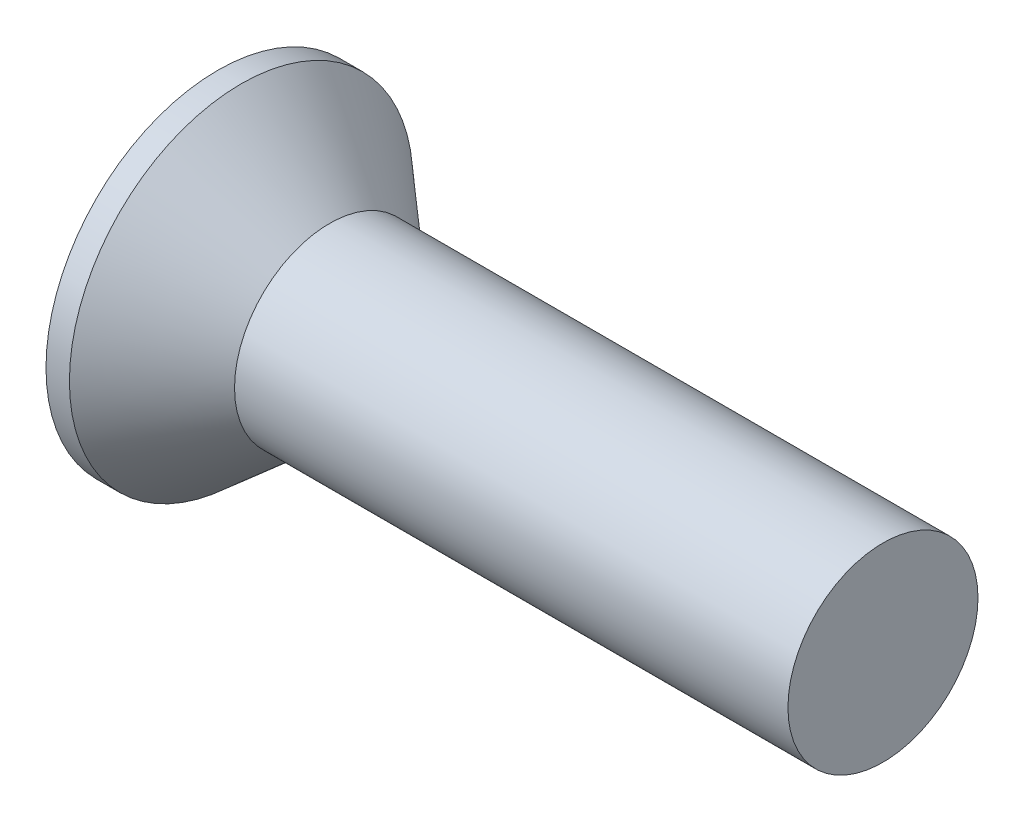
ISO-10303-21;
HEADER;
FILE_DESCRIPTION(('STEP AP214'),'2;1');
FILE_NAME('part.step','',(''),(''),'','','');
FILE_SCHEMA(('AUTOMOTIVE_DESIGN { 1 0 10303 214 1 1 1 1 }'));
ENDSEC;
DATA;
#1=APPLICATION_CONTEXT('core data for automotive mechanical design processes');
#2=APPLICATION_PROTOCOL_DEFINITION('international standard','automotive_design',2000,#1);
#3=PRODUCT_CONTEXT('',#1,'mechanical');
#4=PRODUCT('Part','Part','',(#3));
#5=PRODUCT_RELATED_PRODUCT_CATEGORY('part','',(#4));
#6=PRODUCT_DEFINITION_FORMATION('','',#4);
#7=PRODUCT_DEFINITION_CONTEXT('part definition',#1,'design');
#8=PRODUCT_DEFINITION('design','',#6,#7);
#9=PRODUCT_DEFINITION_SHAPE('','',#8);
#10=(LENGTH_UNIT() NAMED_UNIT(*) SI_UNIT(.MILLI.,.METRE.));
#11=(NAMED_UNIT(*) PLANE_ANGLE_UNIT() SI_UNIT($,.RADIAN.));
#12=(NAMED_UNIT(*) SI_UNIT($,.STERADIAN.) SOLID_ANGLE_UNIT());
#13=UNCERTAINTY_MEASURE_WITH_UNIT(LENGTH_MEASURE(1.E-05),#10,'distance_accuracy_value','');
#14=(GEOMETRIC_REPRESENTATION_CONTEXT(3) GLOBAL_UNCERTAINTY_ASSIGNED_CONTEXT((#13)) GLOBAL_UNIT_ASSIGNED_CONTEXT((#10,
#11,#12)) REPRESENTATION_CONTEXT('',''));
#15=CARTESIAN_POINT('',(0.,0.,0.));
#16=DIRECTION('',(0.,0.,1.));
#17=DIRECTION('',(1.,0.,0.));
#18=AXIS2_PLACEMENT_3D('',#15,#16,#17);
#19=CARTESIAN_POINT('',(0.,0.,0.));
#20=DIRECTION('',(-1.,0.,0.));
#21=DIRECTION('',(0.,0.,1.));
#22=AXIS2_PLACEMENT_3D('',#19,#20,#21);
#23=PLANE('',#22);
#24=CARTESIAN_POINT('',(0.,0.,0.));
#25=DIRECTION('',(-1.,0.,0.));
#26=DIRECTION('',(0.,0.,1.));
#27=AXIS2_PLACEMENT_3D('',#24,#25,#26);
#28=CIRCLE('',#27,5.7404);
#29=CARTESIAN_POINT('',(0.,0.,5.7404));
#30=VERTEX_POINT('',#29);
#31=EDGE_CURVE('E39',#30,#30,#28,.T.);
#32=ORIENTED_EDGE('',*,*,#31,.T.);
#33=EDGE_LOOP('',(#32));
#34=FACE_BOUND('',#33,.T.);
#35=DIRECTION('',(0.,1.,0.));
#36=VECTOR('',#35,1.);
#37=CARTESIAN_POINT('',(0.,-4.5085,-0.7747));
#38=LINE('',#37,#36);
#39=CARTESIAN_POINT('',(0.,-4.5085,-0.7747));
#40=VERTEX_POINT('',#39);
#41=CARTESIAN_POINT('',(0.,-0.774699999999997,-0.7747));
#42=VERTEX_POINT('',#41);
#43=EDGE_CURVE('E100',#40,#42,#38,.T.);
#44=ORIENTED_EDGE('',*,*,#43,.T.);
#45=DIRECTION('',(0.,0.,-1.));
#46=VECTOR('',#45,1.);
#47=CARTESIAN_POINT('',(0.,-0.774700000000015,4.5085));
#48=LINE('',#47,#46);
#49=CARTESIAN_POINT('',(0.,-0.774699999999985,-4.5085));
#50=VERTEX_POINT('',#49);
#51=EDGE_CURVE('E80',#42,#50,#48,.T.);
#52=ORIENTED_EDGE('',*,*,#51,.T.);
#53=DIRECTION('',(0.,1.,0.));
#54=VECTOR('',#53,1.);
#55=CARTESIAN_POINT('',(0.,-0.774699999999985,-4.5085));
#56=LINE('',#55,#54);
#57=CARTESIAN_POINT('',(0.,0.774700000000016,-4.5085));
#58=VERTEX_POINT('',#57);
#59=EDGE_CURVE('E335',#50,#58,#56,.T.);
#60=ORIENTED_EDGE('',*,*,#59,.T.);
#61=DIRECTION('',(0.,0.,1.));
#62=VECTOR('',#61,1.);
#63=CARTESIAN_POINT('',(0.,0.774700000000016,-4.5085));
#64=LINE('',#63,#62);
#65=CARTESIAN_POINT('',(0.,0.774700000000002,-0.7747));
#66=VERTEX_POINT('',#65);
#67=EDGE_CURVE('E96',#58,#66,#64,.T.);
#68=ORIENTED_EDGE('',*,*,#67,.T.);
#69=CARTESIAN_POINT('',(0.,4.5085,-0.7747));
#70=VERTEX_POINT('',#69);
#71=EDGE_CURVE('E90',#66,#70,#38,.T.);
#72=ORIENTED_EDGE('',*,*,#71,.T.);
#73=DIRECTION('',(0.,0.,1.));
#74=VECTOR('',#73,1.);
#75=CARTESIAN_POINT('',(0.,4.5085,-0.7747));
#76=LINE('',#75,#74);
#77=CARTESIAN_POINT('',(0.,4.5085,0.774699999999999));
#78=VERTEX_POINT('',#77);
#79=EDGE_CURVE('E93',#70,#78,#76,.T.);
#80=ORIENTED_EDGE('',*,*,#79,.T.);
#81=DIRECTION('',(0.,-1.,0.));
#82=VECTOR('',#81,1.);
#83=CARTESIAN_POINT('',(0.,4.5085,0.774699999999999));
#84=LINE('',#83,#82);
#85=CARTESIAN_POINT('',(0.,0.774699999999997,0.7747));
#86=VERTEX_POINT('',#85);
#87=EDGE_CURVE('E347',#78,#86,#84,.T.);
#88=ORIENTED_EDGE('',*,*,#87,.T.);
#89=CARTESIAN_POINT('',(0.,0.774699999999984,4.5085));
#90=VERTEX_POINT('',#89);
#91=EDGE_CURVE('E330',#86,#90,#64,.T.);
#92=ORIENTED_EDGE('',*,*,#91,.T.);
#93=DIRECTION('',(0.,-1.,0.));
#94=VECTOR('',#93,1.);
#95=CARTESIAN_POINT('',(0.,0.774699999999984,4.5085));
#96=LINE('',#95,#94);
#97=CARTESIAN_POINT('',(0.,-0.774700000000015,4.5085));
#98=VERTEX_POINT('',#97);
#99=EDGE_CURVE('E316',#90,#98,#96,.T.);
#100=ORIENTED_EDGE('',*,*,#99,.T.);
#101=CARTESIAN_POINT('',(0.,-0.774700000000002,0.7747));
#102=VERTEX_POINT('',#101);
#103=EDGE_CURVE('E328',#98,#102,#48,.T.);
#104=ORIENTED_EDGE('',*,*,#103,.T.);
#105=CARTESIAN_POINT('',(0.,-4.5085,0.7747));
#106=VERTEX_POINT('',#105);
#107=EDGE_CURVE('E106',#102,#106,#84,.T.);
#108=ORIENTED_EDGE('',*,*,#107,.T.);
#109=DIRECTION('',(0.,0.,-1.));
#110=VECTOR('',#109,1.);
#111=CARTESIAN_POINT('',(0.,-4.5085,0.7747));
#112=LINE('',#111,#110);
#113=EDGE_CURVE('E129',#106,#40,#112,.T.);
#114=ORIENTED_EDGE('',*,*,#113,.T.);
#115=EDGE_LOOP('',(#44,#52,#60,#68,#72,#80,#88,#92,#100,#104,#108,#114));
#116=FACE_BOUND('',#115,.T.);
#117=ADVANCED_FACE('F32',(#34,#116),#23,.T.);
#118=CARTESIAN_POINT('',(5.66862249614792,0.,0.350942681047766));
#119=DIRECTION('',(-0.074546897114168,0.,-0.997217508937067));
#120=DIRECTION('',(-0.997217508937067,0.,0.074546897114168));
#121=AXIS2_PLACEMENT_3D('',#118,#119,#120);
#122=PLANE('',#121);
#123=ORIENTED_EDGE('',*,*,#107,.F.);
#124=DIRECTION('',(0.994458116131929,0.0743406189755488,-0.0743406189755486));
#125=VECTOR('',#124,1.);
#126=CARTESIAN_POINT('',(5.69456720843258,-0.349003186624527,0.349003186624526));
#127=LINE('',#126,#125);
#128=CARTESIAN_POINT('',(5.1816,-0.387350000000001,0.387349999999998));
#129=VERTEX_POINT('',#128);
#130=EDGE_CURVE('E124',#102,#129,#127,.T.);
#131=ORIENTED_EDGE('',*,*,#130,.T.);
#132=DIRECTION('',(0.781307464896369,0.621407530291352,-0.058406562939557));
#133=VECTOR('',#132,1.);
#134=CARTESIAN_POINT('',(0.,-4.5085,0.7747));
#135=LINE('',#134,#133);
#136=EDGE_CURVE('E101',#106,#129,#135,.T.);
#137=ORIENTED_EDGE('',*,*,#136,.F.);
#138=EDGE_LOOP('',(#123,#131,#137));
#139=FACE_BOUND('',#138,.T.);
#140=ADVANCED_FACE('F152',(#139),#122,.T.);
#141=DIRECTION('',(0.781307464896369,-0.621407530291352,-0.0584065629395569));
#142=VECTOR('',#141,1.);
#143=CARTESIAN_POINT('',(0.,4.5085,0.774699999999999));
#144=LINE('',#143,#142);
#145=CARTESIAN_POINT('',(5.1816,0.387349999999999,0.38735));
#146=VERTEX_POINT('',#145);
#147=EDGE_CURVE('E46',#78,#146,#144,.T.);
#148=ORIENTED_EDGE('',*,*,#147,.T.);
#149=DIRECTION('',(-0.994458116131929,0.0743406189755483,0.0743406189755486));
#150=VECTOR('',#149,1.);
#151=CARTESIAN_POINT('',(5.69456720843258,0.349003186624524,0.349003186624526));
#152=LINE('',#151,#150);
#153=EDGE_CURVE('E343',#146,#86,#152,.T.);
#154=ORIENTED_EDGE('',*,*,#153,.T.);
#155=ORIENTED_EDGE('',*,*,#87,.F.);
#156=EDGE_LOOP('',(#148,#154,#155));
#157=FACE_BOUND('',#156,.T.);
#158=ADVANCED_FACE('F156',(#157),#122,.T.);
#159=CARTESIAN_POINT('',(5.66862249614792,0.,-0.350942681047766));
#160=DIRECTION('',(-0.074546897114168,0.,0.997217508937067));
#161=DIRECTION('',(0.997217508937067,0.,0.074546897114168));
#162=AXIS2_PLACEMENT_3D('',#159,#160,#161);
#163=PLANE('',#162);
#164=DIRECTION('',(0.781307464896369,0.621407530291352,0.058406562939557));
#165=VECTOR('',#164,1.);
#166=CARTESIAN_POINT('',(0.,-4.5085,-0.7747));
#167=LINE('',#166,#165);
#168=CARTESIAN_POINT('',(5.1816,-0.387349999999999,-0.387350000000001));
#169=VERTEX_POINT('',#168);
#170=EDGE_CURVE('E55',#40,#169,#167,.T.);
#171=ORIENTED_EDGE('',*,*,#170,.T.);
#172=DIRECTION('',(-0.994458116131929,-0.0743406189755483,-0.0743406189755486));
#173=VECTOR('',#172,1.);
#174=CARTESIAN_POINT('',(5.69456720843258,-0.349003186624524,-0.349003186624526));
#175=LINE('',#174,#173);
#176=EDGE_CURVE('E11',#169,#42,#175,.T.);
#177=ORIENTED_EDGE('',*,*,#176,.T.);
#178=ORIENTED_EDGE('',*,*,#43,.F.);
#179=EDGE_LOOP('',(#171,#177,#178));
#180=FACE_BOUND('',#179,.T.);
#181=ADVANCED_FACE('F149',(#180),#163,.T.);
#182=ORIENTED_EDGE('',*,*,#71,.F.);
#183=DIRECTION('',(0.994458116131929,-0.0743406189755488,0.0743406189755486));
#184=VECTOR('',#183,1.);
#185=CARTESIAN_POINT('',(5.69456720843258,0.349003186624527,-0.349003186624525));
#186=LINE('',#185,#184);
#187=CARTESIAN_POINT('',(5.1816,0.387349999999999,-0.38735));
#188=VERTEX_POINT('',#187);
#189=EDGE_CURVE('E109',#66,#188,#186,.T.);
#190=ORIENTED_EDGE('',*,*,#189,.T.);
#191=DIRECTION('',(0.781307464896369,-0.621407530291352,0.0584065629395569));
#192=VECTOR('',#191,1.);
#193=CARTESIAN_POINT('',(0.,4.5085,-0.7747));
#194=LINE('',#193,#192);
#195=EDGE_CURVE('E105',#70,#188,#194,.T.);
#196=ORIENTED_EDGE('',*,*,#195,.F.);
#197=EDGE_LOOP('',(#182,#190,#196));
#198=FACE_BOUND('',#197,.T.);
#199=ADVANCED_FACE('F108',(#198),#163,.T.);
#200=CARTESIAN_POINT('',(-6.34999999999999,0.,0.));
#201=DIRECTION('',(-1.,0.,0.));
#202=DIRECTION('',(0.,0.,1.));
#203=AXIS2_PLACEMENT_3D('',#200,#201,#202);
#204=CYLINDRICAL_SURFACE('',#203,5.7404);
#205=CARTESIAN_POINT('',(0.782644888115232,0.,0.));
#206=DIRECTION('',(-1.,0.,0.));
#207=DIRECTION('',(0.,0.,1.));
#208=AXIS2_PLACEMENT_3D('',#205,#206,#207);
#209=CIRCLE('',#208,5.7404);
#210=CARTESIAN_POINT('',(0.782644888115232,0.,5.7404));
#211=VERTEX_POINT('',#210);
#212=EDGE_CURVE('E132',#211,#211,#209,.T.);
#213=ORIENTED_EDGE('',*,*,#212,.T.);
#214=EDGE_LOOP('',(#213));
#215=FACE_BOUND('',#214,.T.);
#216=ORIENTED_EDGE('',*,*,#31,.F.);
#217=EDGE_LOOP('',(#216));
#218=FACE_BOUND('',#217,.T.);
#219=ADVANCED_FACE('F138',(#215,#218),#204,.T.);
#220=CARTESIAN_POINT('',(0.782644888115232,0.,0.));
#221=DIRECTION('',(-1.,0.,0.));
#222=DIRECTION('',(0.,0.,1.));
#223=AXIS2_PLACEMENT_3D('',#220,#221,#222);
#224=CONICAL_SURFACE('',#223,5.7404,0.715584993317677);
#225=CARTESIAN_POINT('',(3.7338,0.,0.));
#226=DIRECTION('',(-1.,0.,0.));
#227=DIRECTION('',(0.,0.,1.));
#228=AXIS2_PLACEMENT_3D('',#225,#226,#227);
#229=CIRCLE('',#228,3.175);
#230=CARTESIAN_POINT('',(3.7338,0.,3.175));
#231=VERTEX_POINT('',#230);
#232=EDGE_CURVE('E128',#231,#231,#229,.T.);
#233=ORIENTED_EDGE('',*,*,#232,.T.);
#234=EDGE_LOOP('',(#233));
#235=FACE_BOUND('',#234,.T.);
#236=ORIENTED_EDGE('',*,*,#212,.F.);
#237=EDGE_LOOP('',(#236));
#238=FACE_BOUND('',#237,.T.);
#239=ADVANCED_FACE('F140',(#235,#238),#224,.T.);
#240=CARTESIAN_POINT('',(-6.34999999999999,0.,0.));
#241=DIRECTION('',(-1.,0.,0.));
#242=DIRECTION('',(0.,0.,1.));
#243=AXIS2_PLACEMENT_3D('',#240,#241,#242);
#244=CYLINDRICAL_SURFACE('',#243,3.175);
#245=CARTESIAN_POINT('',(22.225,0.,0.));
#246=DIRECTION('',(-1.,0.,0.));
#247=DIRECTION('',(0.,0.,1.));
#248=AXIS2_PLACEMENT_3D('',#245,#246,#247);
#249=CIRCLE('',#248,3.175);
#250=CARTESIAN_POINT('',(22.225,0.,3.175));
#251=VERTEX_POINT('',#250);
#252=EDGE_CURVE('E125',#251,#251,#249,.T.);
#253=ORIENTED_EDGE('',*,*,#252,.T.);
#254=EDGE_LOOP('',(#253));
#255=FACE_BOUND('',#254,.T.);
#256=ORIENTED_EDGE('',*,*,#232,.F.);
#257=EDGE_LOOP('',(#256));
#258=FACE_BOUND('',#257,.T.);
#259=ADVANCED_FACE('F146',(#255,#258),#244,.T.);
#260=CARTESIAN_POINT('',(22.225,3.175,0.));
#261=DIRECTION('',(1.,0.,0.));
#262=DIRECTION('',(0.,0.,-1.));
#263=AXIS2_PLACEMENT_3D('',#260,#261,#262);
#264=PLANE('',#263);
#265=ORIENTED_EDGE('',*,*,#252,.F.);
#266=EDGE_LOOP('',(#265));
#267=FACE_BOUND('',#266,.T.);
#268=ADVANCED_FACE('F176',(#267),#264,.T.);
#269=CARTESIAN_POINT('',(5.1816,-0.38735,-0.38735));
#270=DIRECTION('',(-1.,0.,0.));
#271=DIRECTION('',(0.,0.,1.));
#272=AXIS2_PLACEMENT_3D('',#269,#270,#271);
#273=PLANE('',#272);
#274=DIRECTION('',(0.,1.,0.));
#275=VECTOR('',#274,1.);
#276=CARTESIAN_POINT('',(5.1816,-0.38735,-0.38735));
#277=LINE('',#276,#275);
#278=EDGE_CURVE('E120',#169,#188,#277,.T.);
#279=ORIENTED_EDGE('',*,*,#278,.F.);
#280=DIRECTION('',(0.,0.,-1.));
#281=VECTOR('',#280,1.);
#282=CARTESIAN_POINT('',(5.1816,-0.38735,0.38735));
#283=LINE('',#282,#281);
#284=EDGE_CURVE('E111',#129,#169,#283,.T.);
#285=ORIENTED_EDGE('',*,*,#284,.F.);
#286=DIRECTION('',(0.,-1.,0.));
#287=VECTOR('',#286,1.);
#288=CARTESIAN_POINT('',(5.1816,0.38735,0.38735));
#289=LINE('',#288,#287);
#290=EDGE_CURVE('E114',#146,#129,#289,.T.);
#291=ORIENTED_EDGE('',*,*,#290,.F.);
#292=DIRECTION('',(0.,0.,1.));
#293=VECTOR('',#292,1.);
#294=CARTESIAN_POINT('',(5.1816,0.38735,-0.38735));
#295=LINE('',#294,#293);
#296=EDGE_CURVE('E118',#188,#146,#295,.T.);
#297=ORIENTED_EDGE('',*,*,#296,.F.);
#298=EDGE_LOOP('',(#279,#285,#291,#297));
#299=FACE_BOUND('',#298,.T.);
#300=ADVANCED_FACE('F173',(#299),#273,.T.);
#301=CARTESIAN_POINT('',(0.,-4.5085,-0.7747));
#302=DIRECTION('',(-0.622470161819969,0.78264353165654,0.));
#303=DIRECTION('',(-0.78264353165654,-0.622470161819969,0.));
#304=AXIS2_PLACEMENT_3D('',#301,#302,#303);
#305=PLANE('',#304);
#306=ORIENTED_EDGE('',*,*,#170,.F.);
#307=ORIENTED_EDGE('',*,*,#113,.F.);
#308=ORIENTED_EDGE('',*,*,#136,.T.);
#309=ORIENTED_EDGE('',*,*,#284,.T.);
#310=EDGE_LOOP('',(#306,#307,#308,#309));
#311=FACE_BOUND('',#310,.T.);
#312=ADVANCED_FACE('F165',(#311),#305,.T.);
#313=CARTESIAN_POINT('',(5.1816,0.38735,0.38735));
#314=DIRECTION('',(-0.622470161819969,-0.78264353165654,0.));
#315=DIRECTION('',(0.78264353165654,-0.622470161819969,0.));
#316=AXIS2_PLACEMENT_3D('',#313,#314,#315);
#317=PLANE('',#316);
#318=ORIENTED_EDGE('',*,*,#147,.F.);
#319=ORIENTED_EDGE('',*,*,#79,.F.);
#320=ORIENTED_EDGE('',*,*,#195,.T.);
#321=ORIENTED_EDGE('',*,*,#296,.T.);
#322=EDGE_LOOP('',(#318,#319,#320,#321));
#323=FACE_BOUND('',#322,.T.);
#324=ADVANCED_FACE('F104',(#323),#317,.T.);
#325=CARTESIAN_POINT('',(5.66862249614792,-0.350942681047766,0.));
#326=DIRECTION('',(-0.074546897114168,0.997217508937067,0.));
#327=DIRECTION('',(-0.997217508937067,-0.074546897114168,0.));
#328=AXIS2_PLACEMENT_3D('',#325,#326,#327);
#329=PLANE('',#328);
#330=DIRECTION('',(0.781307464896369,0.0584065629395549,0.621407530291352));
#331=VECTOR('',#330,1.);
#332=CARTESIAN_POINT('',(0.,-0.774699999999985,-4.5085));
#333=LINE('',#332,#331);
#334=EDGE_CURVE('E337',#50,#169,#333,.T.);
#335=ORIENTED_EDGE('',*,*,#334,.F.);
#336=ORIENTED_EDGE('',*,*,#51,.F.);
#337=ORIENTED_EDGE('',*,*,#176,.F.);
#338=EDGE_LOOP('',(#335,#336,#337));
#339=FACE_BOUND('',#338,.T.);
#340=ADVANCED_FACE('F172',(#339),#329,.T.);
#341=CARTESIAN_POINT('',(5.66862249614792,0.350942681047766,0.));
#342=DIRECTION('',(-0.074546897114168,-0.997217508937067,0.));
#343=DIRECTION('',(0.997217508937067,-0.074546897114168,0.));
#344=AXIS2_PLACEMENT_3D('',#341,#342,#343);
#345=PLANE('',#344);
#346=ORIENTED_EDGE('',*,*,#67,.F.);
#347=DIRECTION('',(0.781307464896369,-0.0584065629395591,0.621407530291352));
#348=VECTOR('',#347,1.);
#349=CARTESIAN_POINT('',(0.,0.774700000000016,-4.5085));
#350=LINE('',#349,#348);
#351=EDGE_CURVE('E71',#58,#188,#350,.T.);
#352=ORIENTED_EDGE('',*,*,#351,.T.);
#353=ORIENTED_EDGE('',*,*,#189,.F.);
#354=EDGE_LOOP('',(#346,#352,#353));
#355=FACE_BOUND('',#354,.T.);
#356=ADVANCED_FACE('F216',(#355),#345,.T.);
#357=CARTESIAN_POINT('',(0.,0.774700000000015,-4.5085));
#358=DIRECTION('',(-0.622470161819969,0.,0.78264353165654));
#359=DIRECTION('',(-0.78264353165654,0.,-0.622470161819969));
#360=AXIS2_PLACEMENT_3D('',#357,#358,#359);
#361=PLANE('',#360);
#362=ORIENTED_EDGE('',*,*,#351,.F.);
#363=ORIENTED_EDGE('',*,*,#59,.F.);
#364=ORIENTED_EDGE('',*,*,#334,.T.);
#365=ORIENTED_EDGE('',*,*,#278,.T.);
#366=EDGE_LOOP('',(#362,#363,#364,#365));
#367=FACE_BOUND('',#366,.T.);
#368=ADVANCED_FACE('F224',(#367),#361,.T.);
#369=ORIENTED_EDGE('',*,*,#103,.F.);
#370=DIRECTION('',(0.781307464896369,0.0584065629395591,-0.621407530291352));
#371=VECTOR('',#370,1.);
#372=CARTESIAN_POINT('',(0.,-0.774700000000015,4.5085));
#373=LINE('',#372,#371);
#374=EDGE_CURVE('E313',#98,#129,#373,.T.);
#375=ORIENTED_EDGE('',*,*,#374,.T.);
#376=ORIENTED_EDGE('',*,*,#130,.F.);
#377=EDGE_LOOP('',(#369,#375,#376));
#378=FACE_BOUND('',#377,.T.);
#379=ADVANCED_FACE('F218',(#378),#329,.T.);
#380=DIRECTION('',(0.781307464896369,-0.0584065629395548,-0.621407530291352));
#381=VECTOR('',#380,1.);
#382=CARTESIAN_POINT('',(0.,0.774699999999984,4.5085));
#383=LINE('',#382,#381);
#384=EDGE_CURVE('E324',#90,#146,#383,.T.);
#385=ORIENTED_EDGE('',*,*,#384,.F.);
#386=ORIENTED_EDGE('',*,*,#91,.F.);
#387=ORIENTED_EDGE('',*,*,#153,.F.);
#388=EDGE_LOOP('',(#385,#386,#387));
#389=FACE_BOUND('',#388,.T.);
#390=ADVANCED_FACE('F226',(#389),#345,.T.);
#391=CARTESIAN_POINT('',(5.1816,-0.387350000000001,0.387349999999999));
#392=DIRECTION('',(-0.622470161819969,0.,-0.78264353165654));
#393=DIRECTION('',(0.78264353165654,0.,-0.622470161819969));
#394=AXIS2_PLACEMENT_3D('',#391,#392,#393);
#395=PLANE('',#394);
#396=ORIENTED_EDGE('',*,*,#374,.F.);
#397=ORIENTED_EDGE('',*,*,#99,.F.);
#398=ORIENTED_EDGE('',*,*,#384,.T.);
#399=ORIENTED_EDGE('',*,*,#290,.T.);
#400=EDGE_LOOP('',(#396,#397,#398,#399));
#401=FACE_BOUND('',#400,.T.);
#402=ADVANCED_FACE('F245',(#401),#395,.T.);
#403=CLOSED_SHELL('',(#117,#140,#158,#181,#199,#219,#239,#259,#268,#300,#312,#324,#340,#356,
#368,#379,#390,#402));
#404=MANIFOLD_SOLID_BREP('B2',#403);
#405=ADVANCED_BREP_SHAPE_REPRESENTATION('',(#18,#404),#14);
#406=SHAPE_DEFINITION_REPRESENTATION(#9,#405);
ENDSEC;
END-ISO-10303-21;
